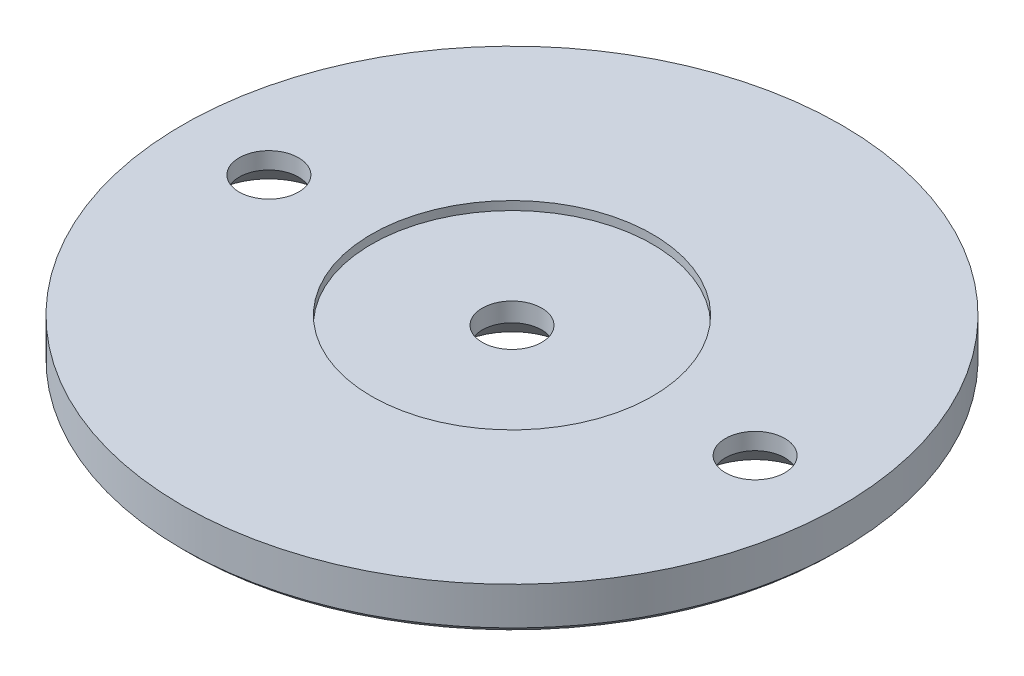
ISO-10303-21;
HEADER;
FILE_DESCRIPTION(('STEP AP214'),'2;1');
FILE_NAME('part.step','',(''),(''),'','','');
FILE_SCHEMA(('AUTOMOTIVE_DESIGN { 1 0 10303 214 1 1 1 1 }'));
ENDSEC;
DATA;
#1=APPLICATION_CONTEXT('core data for automotive mechanical design processes');
#2=APPLICATION_PROTOCOL_DEFINITION('international standard','automotive_design',2000,#1);
#3=PRODUCT_CONTEXT('',#1,'mechanical');
#4=PRODUCT('Part','Part','',(#3));
#5=PRODUCT_RELATED_PRODUCT_CATEGORY('part','',(#4));
#6=PRODUCT_DEFINITION_FORMATION('','',#4);
#7=PRODUCT_DEFINITION_CONTEXT('part definition',#1,'design');
#8=PRODUCT_DEFINITION('design','',#6,#7);
#9=PRODUCT_DEFINITION_SHAPE('','',#8);
#10=(LENGTH_UNIT() NAMED_UNIT(*) SI_UNIT(.MILLI.,.METRE.));
#11=(NAMED_UNIT(*) PLANE_ANGLE_UNIT() SI_UNIT($,.RADIAN.));
#12=(NAMED_UNIT(*) SI_UNIT($,.STERADIAN.) SOLID_ANGLE_UNIT());
#13=UNCERTAINTY_MEASURE_WITH_UNIT(LENGTH_MEASURE(1.E-05),#10,'distance_accuracy_value','');
#14=(GEOMETRIC_REPRESENTATION_CONTEXT(3) GLOBAL_UNCERTAINTY_ASSIGNED_CONTEXT((#13)) GLOBAL_UNIT_ASSIGNED_CONTEXT((#10,
#11,#12)) REPRESENTATION_CONTEXT('',''));
#15=CARTESIAN_POINT('',(0.,0.,0.));
#16=DIRECTION('',(0.,0.,1.));
#17=DIRECTION('',(1.,0.,0.));
#18=AXIS2_PLACEMENT_3D('',#15,#16,#17);
#19=CARTESIAN_POINT('',(0.,-5.,0.));
#20=DIRECTION('',(0.,1.,0.));
#21=DIRECTION('',(0.,0.,1.));
#22=AXIS2_PLACEMENT_3D('',#19,#20,#21);
#23=CYLINDRICAL_SURFACE('',#22,30.5);
#24=CARTESIAN_POINT('',(0.,-3.49999999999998,0.));
#25=DIRECTION('',(0.,-1.,0.));
#26=DIRECTION('',(0.,0.,-1.));
#27=AXIS2_PLACEMENT_3D('',#24,#25,#26);
#28=CIRCLE('',#27,30.5);
#29=CARTESIAN_POINT('',(0.,-3.49999999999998,-30.5));
#30=VERTEX_POINT('',#29);
#31=EDGE_CURVE('E206',#30,#30,#28,.F.);
#32=ORIENTED_EDGE('',*,*,#31,.T.);
#33=EDGE_LOOP('',(#32));
#34=FACE_BOUND('',#33,.T.);
#35=CARTESIAN_POINT('',(0.,0.,0.));
#36=DIRECTION('',(0.,1.,0.));
#37=DIRECTION('',(0.,0.,1.));
#38=AXIS2_PLACEMENT_3D('',#35,#36,#37);
#39=CIRCLE('',#38,30.5);
#40=CARTESIAN_POINT('',(0.,0.,30.5));
#41=VERTEX_POINT('',#40);
#42=EDGE_CURVE('E219',#41,#41,#39,.T.);
#43=ORIENTED_EDGE('',*,*,#42,.F.);
#44=EDGE_LOOP('',(#43));
#45=FACE_BOUND('',#44,.T.);
#46=ADVANCED_FACE('F199',(#34,#45),#23,.T.);
#47=CARTESIAN_POINT('',(0.,-5.,0.));
#48=DIRECTION('',(0.,1.,0.));
#49=DIRECTION('',(0.,0.,1.));
#50=AXIS2_PLACEMENT_3D('',#47,#48,#49);
#51=PLANE('',#50);
#52=CARTESIAN_POINT('',(0.,-5.,0.));
#53=DIRECTION('',(0.,1.,0.));
#54=DIRECTION('',(0.,0.,1.));
#55=AXIS2_PLACEMENT_3D('',#52,#53,#54);
#56=CIRCLE('',#55,15.5);
#57=CARTESIAN_POINT('',(0.,-5.,15.5));
#58=VERTEX_POINT('',#57);
#59=EDGE_CURVE('E214',#58,#58,#56,.F.);
#60=ORIENTED_EDGE('',*,*,#59,.T.);
#61=EDGE_LOOP('',(#60));
#62=FACE_BOUND('',#61,.T.);
#63=CARTESIAN_POINT('',(0.,-5.,0.));
#64=DIRECTION('',(0.,-1.,0.));
#65=DIRECTION('',(0.,0.,-1.));
#66=AXIS2_PLACEMENT_3D('',#63,#64,#65);
#67=CIRCLE('',#66,5.2);
#68=CARTESIAN_POINT('',(0.,-5.,-5.2));
#69=VERTEX_POINT('',#68);
#70=EDGE_CURVE('E244',#69,#69,#67,.T.);
#71=ORIENTED_EDGE('',*,*,#70,.F.);
#72=EDGE_LOOP('',(#71));
#73=FACE_BOUND('',#72,.T.);
#74=ADVANCED_FACE('F282',(#62,#73),#51,.F.);
#75=CARTESIAN_POINT('',(0.,0.,0.));
#76=DIRECTION('',(0.,1.,0.));
#77=DIRECTION('',(0.,0.,1.));
#78=AXIS2_PLACEMENT_3D('',#75,#76,#77);
#79=PLANE('',#78);
#80=CARTESIAN_POINT('',(22.5,0.,0.));
#81=DIRECTION('',(0.,1.,0.));
#82=DIRECTION('',(0.,0.,1.));
#83=AXIS2_PLACEMENT_3D('',#80,#81,#82);
#84=CIRCLE('',#83,2.75);
#85=CARTESIAN_POINT('',(22.5,0.,2.75));
#86=VERTEX_POINT('',#85);
#87=EDGE_CURVE('E220',#86,#86,#84,.T.);
#88=ORIENTED_EDGE('',*,*,#87,.F.);
#89=EDGE_LOOP('',(#88));
#90=FACE_BOUND('',#89,.T.);
#91=CARTESIAN_POINT('',(-22.5,0.,0.));
#92=DIRECTION('',(0.,1.,0.));
#93=DIRECTION('',(0.,0.,1.));
#94=AXIS2_PLACEMENT_3D('',#91,#92,#93);
#95=CIRCLE('',#94,2.75);
#96=CARTESIAN_POINT('',(-22.5,0.,2.75));
#97=VERTEX_POINT('',#96);
#98=EDGE_CURVE('E225',#97,#97,#95,.T.);
#99=ORIENTED_EDGE('',*,*,#98,.F.);
#100=EDGE_LOOP('',(#99));
#101=FACE_BOUND('',#100,.T.);
#102=CARTESIAN_POINT('',(0.,0.,0.));
#103=DIRECTION('',(0.,1.,0.));
#104=DIRECTION('',(0.,0.,1.));
#105=AXIS2_PLACEMENT_3D('',#102,#103,#104);
#106=CIRCLE('',#105,13.);
#107=CARTESIAN_POINT('',(0.,0.,13.));
#108=VERTEX_POINT('',#107);
#109=EDGE_CURVE('E233',#108,#108,#106,.T.);
#110=ORIENTED_EDGE('',*,*,#109,.F.);
#111=EDGE_LOOP('',(#110));
#112=FACE_BOUND('',#111,.T.);
#113=ORIENTED_EDGE('',*,*,#42,.T.);
#114=EDGE_LOOP('',(#113));
#115=FACE_BOUND('',#114,.T.);
#116=ADVANCED_FACE('F287',(#90,#101,#112,#115),#79,.T.);
#117=CARTESIAN_POINT('',(0.,-0.8,0.));
#118=DIRECTION('',(0.,1.,0.));
#119=DIRECTION('',(0.,0.,1.));
#120=AXIS2_PLACEMENT_3D('',#117,#118,#119);
#121=CYLINDRICAL_SURFACE('',#120,13.);
#122=CARTESIAN_POINT('',(0.,-0.8,0.));
#123=DIRECTION('',(0.,1.,0.));
#124=DIRECTION('',(0.,0.,1.));
#125=AXIS2_PLACEMENT_3D('',#122,#123,#124);
#126=CIRCLE('',#125,13.);
#127=CARTESIAN_POINT('',(0.,-0.8,13.));
#128=VERTEX_POINT('',#127);
#129=EDGE_CURVE('E237',#128,#128,#126,.T.);
#130=ORIENTED_EDGE('',*,*,#129,.F.);
#131=EDGE_LOOP('',(#130));
#132=FACE_BOUND('',#131,.T.);
#133=ORIENTED_EDGE('',*,*,#109,.T.);
#134=EDGE_LOOP('',(#133));
#135=FACE_BOUND('',#134,.T.);
#136=ADVANCED_FACE('F323',(#132,#135),#121,.F.);
#137=CARTESIAN_POINT('',(0.,-0.8,0.));
#138=DIRECTION('',(0.,1.,0.));
#139=DIRECTION('',(0.,0.,1.));
#140=AXIS2_PLACEMENT_3D('',#137,#138,#139);
#141=PLANE('',#140);
#142=CARTESIAN_POINT('',(0.,-0.8,0.));
#143=DIRECTION('',(0.,1.,0.));
#144=DIRECTION('',(0.,0.,1.));
#145=AXIS2_PLACEMENT_3D('',#142,#143,#144);
#146=CIRCLE('',#145,2.75);
#147=CARTESIAN_POINT('',(0.,-0.8,2.75));
#148=VERTEX_POINT('',#147);
#149=EDGE_CURVE('E230',#148,#148,#146,.T.);
#150=ORIENTED_EDGE('',*,*,#149,.F.);
#151=EDGE_LOOP('',(#150));
#152=FACE_BOUND('',#151,.T.);
#153=ORIENTED_EDGE('',*,*,#129,.T.);
#154=EDGE_LOOP('',(#153));
#155=FACE_BOUND('',#154,.T.);
#156=ADVANCED_FACE('F316',(#152,#155),#141,.T.);
#157=CARTESIAN_POINT('',(0.,-5.,0.));
#158=DIRECTION('',(0.,-1.,0.));
#159=DIRECTION('',(0.,0.,-1.));
#160=AXIS2_PLACEMENT_3D('',#157,#158,#159);
#161=CYLINDRICAL_SURFACE('',#160,2.75);
#162=ORIENTED_EDGE('',*,*,#149,.T.);
#163=EDGE_LOOP('',(#162));
#164=FACE_BOUND('',#163,.T.);
#165=CARTESIAN_POINT('',(0.,-2.55,0.));
#166=DIRECTION('',(0.,-1.,0.));
#167=DIRECTION('',(0.,0.,-1.));
#168=AXIS2_PLACEMENT_3D('',#165,#166,#167);
#169=CIRCLE('',#168,2.75);
#170=CARTESIAN_POINT('',(0.,-2.55,-2.75));
#171=VERTEX_POINT('',#170);
#172=EDGE_CURVE('E234',#171,#171,#169,.T.);
#173=ORIENTED_EDGE('',*,*,#172,.T.);
#174=EDGE_LOOP('',(#173));
#175=FACE_BOUND('',#174,.T.);
#176=ADVANCED_FACE('F310',(#164,#175),#161,.F.);
#177=CARTESIAN_POINT('',(0.,-5.,0.));
#178=DIRECTION('',(0.,-1.,0.));
#179=DIRECTION('',(0.,0.,-1.));
#180=AXIS2_PLACEMENT_3D('',#177,#178,#179);
#181=CONICAL_SURFACE('',#180,5.2,0.785398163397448);
#182=ORIENTED_EDGE('',*,*,#172,.F.);
#183=EDGE_LOOP('',(#182));
#184=FACE_BOUND('',#183,.T.);
#185=ORIENTED_EDGE('',*,*,#70,.T.);
#186=EDGE_LOOP('',(#185));
#187=FACE_BOUND('',#186,.T.);
#188=ADVANCED_FACE('F265',(#184,#187),#181,.F.);
#189=CARTESIAN_POINT('',(0.,-4.,0.));
#190=DIRECTION('',(0.,-1.,0.));
#191=DIRECTION('',(0.,0.,-1.));
#192=AXIS2_PLACEMENT_3D('',#189,#190,#191);
#193=PLANE('',#192);
#194=CARTESIAN_POINT('',(0.,-4.,0.));
#195=DIRECTION('',(0.,-1.,0.));
#196=DIRECTION('',(0.,0.,-1.));
#197=AXIS2_PLACEMENT_3D('',#194,#195,#196);
#198=CIRCLE('',#197,30.);
#199=CARTESIAN_POINT('',(0.,-4.,-30.));
#200=VERTEX_POINT('',#199);
#201=EDGE_CURVE('E12',#200,#200,#198,.T.);
#202=ORIENTED_EDGE('',*,*,#201,.T.);
#203=EDGE_LOOP('',(#202));
#204=FACE_BOUND('',#203,.T.);
#205=CARTESIAN_POINT('',(22.5,-4.,0.));
#206=DIRECTION('',(0.,-1.,0.));
#207=DIRECTION('',(0.,0.,-1.));
#208=AXIS2_PLACEMENT_3D('',#205,#206,#207);
#209=CIRCLE('',#208,5.2);
#210=CARTESIAN_POINT('',(22.5,-4.,-5.2));
#211=VERTEX_POINT('',#210);
#212=EDGE_CURVE('E255',#211,#211,#209,.T.);
#213=ORIENTED_EDGE('',*,*,#212,.F.);
#214=EDGE_LOOP('',(#213));
#215=FACE_BOUND('',#214,.T.);
#216=CARTESIAN_POINT('',(-22.5,-4.,0.));
#217=DIRECTION('',(0.,-1.,0.));
#218=DIRECTION('',(0.,0.,-1.));
#219=AXIS2_PLACEMENT_3D('',#216,#217,#218);
#220=CIRCLE('',#219,5.2);
#221=CARTESIAN_POINT('',(-22.5,-4.,-5.2));
#222=VERTEX_POINT('',#221);
#223=EDGE_CURVE('E223',#222,#222,#220,.T.);
#224=ORIENTED_EDGE('',*,*,#223,.F.);
#225=EDGE_LOOP('',(#224));
#226=FACE_BOUND('',#225,.T.);
#227=CARTESIAN_POINT('',(0.,-4.,0.));
#228=DIRECTION('',(0.,-1.,0.));
#229=DIRECTION('',(0.,0.,-1.));
#230=AXIS2_PLACEMENT_3D('',#227,#228,#229);
#231=CIRCLE('',#230,16.);
#232=CARTESIAN_POINT('',(0.,-4.,-16.));
#233=VERTEX_POINT('',#232);
#234=EDGE_CURVE('E228',#233,#233,#231,.T.);
#235=ORIENTED_EDGE('',*,*,#234,.F.);
#236=EDGE_LOOP('',(#235));
#237=FACE_BOUND('',#236,.T.);
#238=ADVANCED_FACE('F261',(#204,#215,#226,#237),#193,.T.);
#239=CARTESIAN_POINT('',(0.,-4.,0.));
#240=DIRECTION('',(0.,-1.,0.));
#241=DIRECTION('',(0.,0.,-1.));
#242=AXIS2_PLACEMENT_3D('',#239,#240,#241);
#243=CYLINDRICAL_SURFACE('',#242,16.);
#244=CARTESIAN_POINT('',(0.,-4.49999999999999,0.));
#245=DIRECTION('',(0.,1.,0.));
#246=DIRECTION('',(0.,0.,1.));
#247=AXIS2_PLACEMENT_3D('',#244,#245,#246);
#248=CIRCLE('',#247,16.);
#249=CARTESIAN_POINT('',(0.,-4.49999999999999,16.));
#250=VERTEX_POINT('',#249);
#251=EDGE_CURVE('E210',#250,#250,#248,.T.);
#252=ORIENTED_EDGE('',*,*,#251,.T.);
#253=EDGE_LOOP('',(#252));
#254=FACE_BOUND('',#253,.T.);
#255=ORIENTED_EDGE('',*,*,#234,.T.);
#256=EDGE_LOOP('',(#255));
#257=FACE_BOUND('',#256,.T.);
#258=ADVANCED_FACE('F264',(#254,#257),#243,.T.);
#259=CARTESIAN_POINT('',(-22.5,-4.,0.));
#260=DIRECTION('',(0.,-1.,0.));
#261=DIRECTION('',(0.,0.,-1.));
#262=AXIS2_PLACEMENT_3D('',#259,#260,#261);
#263=CYLINDRICAL_SURFACE('',#262,2.75);
#264=ORIENTED_EDGE('',*,*,#98,.T.);
#265=EDGE_LOOP('',(#264));
#266=FACE_BOUND('',#265,.T.);
#267=CARTESIAN_POINT('',(-22.5,-1.55,0.));
#268=DIRECTION('',(0.,-1.,0.));
#269=DIRECTION('',(0.,0.,-1.));
#270=AXIS2_PLACEMENT_3D('',#267,#268,#269);
#271=CIRCLE('',#270,2.75);
#272=CARTESIAN_POINT('',(-22.5,-1.55,-2.75));
#273=VERTEX_POINT('',#272);
#274=EDGE_CURVE('E229',#273,#273,#271,.T.);
#275=ORIENTED_EDGE('',*,*,#274,.T.);
#276=EDGE_LOOP('',(#275));
#277=FACE_BOUND('',#276,.T.);
#278=ADVANCED_FACE('F272',(#266,#277),#263,.F.);
#279=CARTESIAN_POINT('',(-22.5,-4.,0.));
#280=DIRECTION('',(0.,-1.,0.));
#281=DIRECTION('',(0.,0.,-1.));
#282=AXIS2_PLACEMENT_3D('',#279,#280,#281);
#283=CONICAL_SURFACE('',#282,5.2,0.785398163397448);
#284=ORIENTED_EDGE('',*,*,#274,.F.);
#285=EDGE_LOOP('',(#284));
#286=FACE_BOUND('',#285,.T.);
#287=ORIENTED_EDGE('',*,*,#223,.T.);
#288=EDGE_LOOP('',(#287));
#289=FACE_BOUND('',#288,.T.);
#290=ADVANCED_FACE('F278',(#286,#289),#283,.F.);
#291=CARTESIAN_POINT('',(22.5,-4.,0.));
#292=DIRECTION('',(0.,-1.,0.));
#293=DIRECTION('',(0.,0.,-1.));
#294=AXIS2_PLACEMENT_3D('',#291,#292,#293);
#295=CYLINDRICAL_SURFACE('',#294,2.75);
#296=ORIENTED_EDGE('',*,*,#87,.T.);
#297=EDGE_LOOP('',(#296));
#298=FACE_BOUND('',#297,.T.);
#299=CARTESIAN_POINT('',(22.5,-1.55,0.));
#300=DIRECTION('',(0.,-1.,0.));
#301=DIRECTION('',(0.,0.,-1.));
#302=AXIS2_PLACEMENT_3D('',#299,#300,#301);
#303=CIRCLE('',#302,2.75);
#304=CARTESIAN_POINT('',(22.5,-1.55,-2.75));
#305=VERTEX_POINT('',#304);
#306=EDGE_CURVE('E224',#305,#305,#303,.T.);
#307=ORIENTED_EDGE('',*,*,#306,.T.);
#308=EDGE_LOOP('',(#307));
#309=FACE_BOUND('',#308,.T.);
#310=ADVANCED_FACE('F300',(#298,#309),#295,.F.);
#311=CARTESIAN_POINT('',(22.5,-4.,0.));
#312=DIRECTION('',(0.,-1.,0.));
#313=DIRECTION('',(0.,0.,-1.));
#314=AXIS2_PLACEMENT_3D('',#311,#312,#313);
#315=CONICAL_SURFACE('',#314,5.2,0.785398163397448);
#316=ORIENTED_EDGE('',*,*,#306,.F.);
#317=EDGE_LOOP('',(#316));
#318=FACE_BOUND('',#317,.T.);
#319=ORIENTED_EDGE('',*,*,#212,.T.);
#320=EDGE_LOOP('',(#319));
#321=FACE_BOUND('',#320,.T.);
#322=ADVANCED_FACE('F259',(#318,#321),#315,.F.);
#323=CARTESIAN_POINT('',(0.,-5.,0.));
#324=DIRECTION('',(0.,1.,0.));
#325=DIRECTION('',(0.,0.,1.));
#326=AXIS2_PLACEMENT_3D('',#323,#324,#325);
#327=CONICAL_SURFACE('',#326,15.5,0.785398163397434);
#328=ORIENTED_EDGE('',*,*,#251,.F.);
#329=EDGE_LOOP('',(#328));
#330=FACE_BOUND('',#329,.T.);
#331=ORIENTED_EDGE('',*,*,#59,.F.);
#332=EDGE_LOOP('',(#331));
#333=FACE_BOUND('',#332,.T.);
#334=ADVANCED_FACE('F292',(#330,#333),#327,.T.);
#335=CARTESIAN_POINT('',(0.,-3.49999999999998,0.));
#336=DIRECTION('',(0.,1.,0.));
#337=DIRECTION('',(0.,0.,1.));
#338=AXIS2_PLACEMENT_3D('',#335,#336,#337);
#339=CONICAL_SURFACE('',#338,30.5,0.785398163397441);
#340=ORIENTED_EDGE('',*,*,#201,.F.);
#341=EDGE_LOOP('',(#340));
#342=FACE_BOUND('',#341,.T.);
#343=ORIENTED_EDGE('',*,*,#31,.F.);
#344=EDGE_LOOP('',(#343));
#345=FACE_BOUND('',#344,.T.);
#346=ADVANCED_FACE('F201',(#342,#345),#339,.T.);
#347=CLOSED_SHELL('',(#46,#74,#116,#136,#156,#176,#188,#238,#258,#278,#290,#310,#322,#334,#346));
#348=MANIFOLD_SOLID_BREP('B2',#347);
#349=ADVANCED_BREP_SHAPE_REPRESENTATION('',(#18,#348),#14);
#350=SHAPE_DEFINITION_REPRESENTATION(#9,#349);
ENDSEC;
END-ISO-10303-21;
